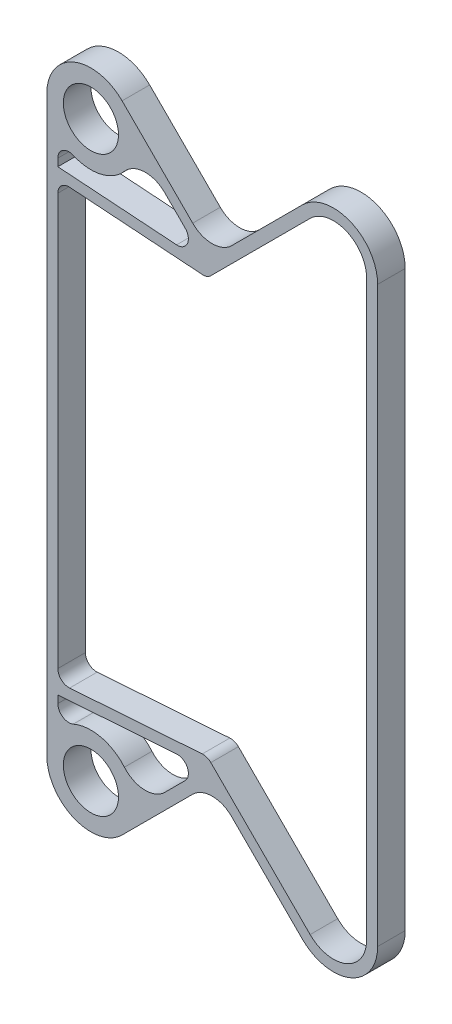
ISO-10303-21;
HEADER;
FILE_DESCRIPTION(('STEP AP214'),'2;1');
FILE_NAME('part.step','',(''),(''),'','','');
FILE_SCHEMA(('AUTOMOTIVE_DESIGN { 1 0 10303 214 1 1 1 1 }'));
ENDSEC;
DATA;
#1=APPLICATION_CONTEXT('core data for automotive mechanical design processes');
#2=APPLICATION_PROTOCOL_DEFINITION('international standard','automotive_design',2000,#1);
#3=PRODUCT_CONTEXT('',#1,'mechanical');
#4=PRODUCT('Part','Part','',(#3));
#5=PRODUCT_RELATED_PRODUCT_CATEGORY('part','',(#4));
#6=PRODUCT_DEFINITION_FORMATION('','',#4);
#7=PRODUCT_DEFINITION_CONTEXT('part definition',#1,'design');
#8=PRODUCT_DEFINITION('design','',#6,#7);
#9=PRODUCT_DEFINITION_SHAPE('','',#8);
#10=(LENGTH_UNIT() NAMED_UNIT(*) SI_UNIT(.MILLI.,.METRE.));
#11=(NAMED_UNIT(*) PLANE_ANGLE_UNIT() SI_UNIT($,.RADIAN.));
#12=(NAMED_UNIT(*) SI_UNIT($,.STERADIAN.) SOLID_ANGLE_UNIT());
#13=UNCERTAINTY_MEASURE_WITH_UNIT(LENGTH_MEASURE(1.E-05),#10,'distance_accuracy_value','');
#14=(GEOMETRIC_REPRESENTATION_CONTEXT(3) GLOBAL_UNCERTAINTY_ASSIGNED_CONTEXT((#13)) GLOBAL_UNIT_ASSIGNED_CONTEXT((#10,
#11,#12)) REPRESENTATION_CONTEXT('',''));
#15=CARTESIAN_POINT('',(0.,0.,0.));
#16=DIRECTION('',(0.,0.,1.));
#17=DIRECTION('',(1.,0.,0.));
#18=AXIS2_PLACEMENT_3D('',#15,#16,#17);
#19=CARTESIAN_POINT('',(299.967205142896,0.,50.));
#20=DIRECTION('',(-1.,0.,0.));
#21=DIRECTION('',(0.,-1.,0.));
#22=AXIS2_PLACEMENT_3D('',#19,#20,#21);
#23=PLANE('',#22);
#24=DIRECTION('',(0.,1.,0.));
#25=VECTOR('',#24,1.);
#26=CARTESIAN_POINT('',(299.967205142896,0.,0.));
#27=LINE('',#26,#25);
#28=CARTESIAN_POINT('',(299.967205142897,-517.709563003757,0.));
#29=VERTEX_POINT('',#28);
#30=CARTESIAN_POINT('',(299.967205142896,517.70956300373,0.));
#31=VERTEX_POINT('',#30);
#32=EDGE_CURVE('E451',#29,#31,#27,.T.);
#33=ORIENTED_EDGE('',*,*,#32,.F.);
#34=DIRECTION('',(0.,0.,-1.));
#35=VECTOR('',#34,1.);
#36=CARTESIAN_POINT('',(299.967205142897,-517.709563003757,50.));
#37=LINE('',#36,#35);
#38=CARTESIAN_POINT('',(299.967205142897,-517.709563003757,50.));
#39=VERTEX_POINT('',#38);
#40=EDGE_CURVE('E11',#39,#29,#37,.T.);
#41=ORIENTED_EDGE('',*,*,#40,.F.);
#42=DIRECTION('',(0.,1.,0.));
#43=VECTOR('',#42,1.);
#44=CARTESIAN_POINT('',(299.967205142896,0.,50.));
#45=LINE('',#44,#43);
#46=CARTESIAN_POINT('',(299.967205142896,517.70956300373,50.));
#47=VERTEX_POINT('',#46);
#48=EDGE_CURVE('E738',#39,#47,#45,.T.);
#49=ORIENTED_EDGE('',*,*,#48,.T.);
#50=DIRECTION('',(0.,0.,-1.));
#51=VECTOR('',#50,1.);
#52=CARTESIAN_POINT('',(299.967205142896,517.70956300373,50.));
#53=LINE('',#52,#51);
#54=EDGE_CURVE('E66',#47,#31,#53,.T.);
#55=ORIENTED_EDGE('',*,*,#54,.T.);
#56=EDGE_LOOP('',(#33,#41,#49,#55));
#57=FACE_BOUND('',#56,.T.);
#58=ADVANCED_FACE('F46',(#57),#23,.T.);
#59=CARTESIAN_POINT('',(219.999999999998,-519.999999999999,50.));
#60=DIRECTION('',(0.,0.,-1.));
#61=DIRECTION('',(-1.,0.,0.));
#62=AXIS2_PLACEMENT_3D('',#59,#60,#61);
#63=CYLINDRICAL_SURFACE('',#62,80.0000000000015);
#64=CARTESIAN_POINT('',(219.999999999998,-519.999999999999,0.));
#65=DIRECTION('',(0.,0.,1.));
#66=DIRECTION('',(1.,0.,0.));
#67=AXIS2_PLACEMENT_3D('',#64,#65,#66);
#68=CIRCLE('',#67,80.0000000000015);
#69=CARTESIAN_POINT('',(299.967205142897,-522.29043699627,0.));
#70=VERTEX_POINT('',#69);
#71=EDGE_CURVE('E454',#29,#70,#68,.F.);
#72=ORIENTED_EDGE('',*,*,#71,.T.);
#73=DIRECTION('',(0.,0.,-1.));
#74=VECTOR('',#73,1.);
#75=CARTESIAN_POINT('',(299.967205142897,-522.29043699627,50.));
#76=LINE('',#75,#74);
#77=CARTESIAN_POINT('',(299.967205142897,-522.29043699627,50.));
#78=VERTEX_POINT('',#77);
#79=EDGE_CURVE('E57',#78,#70,#76,.T.);
#80=ORIENTED_EDGE('',*,*,#79,.F.);
#81=CARTESIAN_POINT('',(219.999999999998,-519.999999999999,50.));
#82=DIRECTION('',(0.,0.,1.));
#83=DIRECTION('',(1.,0.,0.));
#84=AXIS2_PLACEMENT_3D('',#81,#82,#83);
#85=CIRCLE('',#84,80.0000000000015);
#86=EDGE_CURVE('E741',#39,#78,#85,.F.);
#87=ORIENTED_EDGE('',*,*,#86,.F.);
#88=ORIENTED_EDGE('',*,*,#40,.T.);
#89=EDGE_LOOP('',(#72,#80,#87,#88));
#90=FACE_BOUND('',#89,.T.);
#91=ADVANCED_FACE('F796',(#90),#63,.F.);
#92=CARTESIAN_POINT('',(379.934410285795,-519.999999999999,50.));
#93=DIRECTION('',(0.,0.,-1.));
#94=DIRECTION('',(-1.,0.,0.));
#95=AXIS2_PLACEMENT_3D('',#92,#93,#94);
#96=CYLINDRICAL_SURFACE('',#95,80.0000000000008);
#97=CARTESIAN_POINT('',(379.934410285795,-519.999999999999,0.));
#98=DIRECTION('',(0.,0.,1.));
#99=DIRECTION('',(1.,0.,0.));
#100=AXIS2_PLACEMENT_3D('',#97,#98,#99);
#101=CIRCLE('',#100,80.0000000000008);
#102=CARTESIAN_POINT('',(436.502952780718,-576.568542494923,0.));
#103=VERTEX_POINT('',#102);
#104=EDGE_CURVE('E458',#70,#103,#101,.T.);
#105=ORIENTED_EDGE('',*,*,#104,.T.);
#106=DIRECTION('',(0.,0.,-1.));
#107=VECTOR('',#106,1.);
#108=CARTESIAN_POINT('',(436.502952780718,-576.568542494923,50.));
#109=LINE('',#108,#107);
#110=CARTESIAN_POINT('',(436.502952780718,-576.568542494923,50.));
#111=VERTEX_POINT('',#110);
#112=EDGE_CURVE('E532',#111,#103,#109,.T.);
#113=ORIENTED_EDGE('',*,*,#112,.F.);
#114=CARTESIAN_POINT('',(379.934410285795,-519.999999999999,50.));
#115=DIRECTION('',(0.,0.,1.));
#116=DIRECTION('',(1.,0.,0.));
#117=AXIS2_PLACEMENT_3D('',#114,#115,#116);
#118=CIRCLE('',#117,80.0000000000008);
#119=EDGE_CURVE('E745',#78,#111,#118,.T.);
#120=ORIENTED_EDGE('',*,*,#119,.F.);
#121=ORIENTED_EDGE('',*,*,#79,.T.);
#122=EDGE_LOOP('',(#105,#113,#120,#121));
#123=FACE_BOUND('',#122,.T.);
#124=ADVANCED_FACE('F801',(#123),#96,.T.);
#125=CARTESIAN_POINT('',(506.53574763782,-506.535747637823,50.));
#126=DIRECTION('',(0.707106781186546,-0.70710678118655,0.));
#127=DIRECTION('',(0.70710678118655,0.707106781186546,0.));
#128=AXIS2_PLACEMENT_3D('',#125,#126,#127);
#129=PLANE('',#128);
#130=DIRECTION('',(-0.70710678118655,-0.707106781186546,0.));
#131=VECTOR('',#130,1.);
#132=CARTESIAN_POINT('',(506.53574763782,-506.535747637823,0.));
#133=LINE('',#132,#131);
#134=CARTESIAN_POINT('',(564.579071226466,-448.492424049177,0.));
#135=VERTEX_POINT('',#134);
#136=EDGE_CURVE('E462',#135,#103,#133,.T.);
#137=ORIENTED_EDGE('',*,*,#136,.F.);
#138=DIRECTION('',(0.,0.,-1.));
#139=VECTOR('',#138,1.);
#140=CARTESIAN_POINT('',(564.579071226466,-448.492424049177,50.));
#141=LINE('',#140,#139);
#142=CARTESIAN_POINT('',(564.579071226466,-448.492424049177,50.));
#143=VERTEX_POINT('',#142);
#144=EDGE_CURVE('E529',#143,#135,#141,.T.);
#145=ORIENTED_EDGE('',*,*,#144,.F.);
#146=DIRECTION('',(-0.70710678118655,-0.707106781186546,0.));
#147=VECTOR('',#146,1.);
#148=CARTESIAN_POINT('',(506.53574763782,-506.535747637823,50.));
#149=LINE('',#148,#147);
#150=EDGE_CURVE('E748',#143,#111,#149,.T.);
#151=ORIENTED_EDGE('',*,*,#150,.T.);
#152=ORIENTED_EDGE('',*,*,#112,.T.);
#153=EDGE_LOOP('',(#137,#145,#151,#152));
#154=FACE_BOUND('',#153,.T.);
#155=ADVANCED_FACE('F1069',(#154),#129,.T.);
#156=CARTESIAN_POINT('',(599.934410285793,-483.847763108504,50.));
#157=DIRECTION('',(0.,0.,-1.));
#158=DIRECTION('',(-1.,0.,0.));
#159=AXIS2_PLACEMENT_3D('',#156,#157,#158);
#160=CYLINDRICAL_SURFACE('',#159,50.0000000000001);
#161=CARTESIAN_POINT('',(599.934410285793,-483.847763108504,0.));
#162=DIRECTION('',(0.,0.,1.));
#163=DIRECTION('',(1.,0.,0.));
#164=AXIS2_PLACEMENT_3D('',#161,#162,#163);
#165=CIRCLE('',#164,50.0000000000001);
#166=CARTESIAN_POINT('',(635.289749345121,-448.492424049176,0.));
#167=VERTEX_POINT('',#166);
#168=EDGE_CURVE('E466',#135,#167,#165,.F.);
#169=ORIENTED_EDGE('',*,*,#168,.T.);
#170=DIRECTION('',(0.,0.,-1.));
#171=VECTOR('',#170,1.);
#172=CARTESIAN_POINT('',(635.289749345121,-448.492424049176,50.));
#173=LINE('',#172,#171);
#174=CARTESIAN_POINT('',(635.289749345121,-448.492424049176,50.));
#175=VERTEX_POINT('',#174);
#176=EDGE_CURVE('E526',#175,#167,#173,.T.);
#177=ORIENTED_EDGE('',*,*,#176,.F.);
#178=CARTESIAN_POINT('',(599.934410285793,-483.847763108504,50.));
#179=DIRECTION('',(0.,0.,1.));
#180=DIRECTION('',(1.,0.,0.));
#181=AXIS2_PLACEMENT_3D('',#178,#179,#180);
#182=CIRCLE('',#181,50.0000000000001);
#183=EDGE_CURVE('E752',#143,#175,#182,.F.);
#184=ORIENTED_EDGE('',*,*,#183,.F.);
#185=ORIENTED_EDGE('',*,*,#144,.T.);
#186=EDGE_LOOP('',(#169,#177,#184,#185));
#187=FACE_BOUND('',#186,.T.);
#188=ADVANCED_FACE('F1060',(#187),#160,.F.);
#189=CARTESIAN_POINT('',(93.3986626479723,93.3986626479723,50.));
#190=DIRECTION('',(-0.707106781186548,-0.707106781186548,0.));
#191=DIRECTION('',(0.707106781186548,-0.707106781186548,0.));
#192=AXIS2_PLACEMENT_3D('',#189,#190,#191);
#193=PLANE('',#192);
#194=DIRECTION('',(-0.707106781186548,0.707106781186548,0.));
#195=VECTOR('',#194,1.);
#196=CARTESIAN_POINT('',(93.3986626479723,93.3986626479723,0.));
#197=LINE('',#196,#195);
#198=CARTESIAN_POINT('',(763.365867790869,-576.568542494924,0.));
#199=VERTEX_POINT('',#198);
#200=EDGE_CURVE('E470',#199,#167,#197,.T.);
#201=ORIENTED_EDGE('',*,*,#200,.F.);
#202=DIRECTION('',(0.,0.,-1.));
#203=VECTOR('',#202,1.);
#204=CARTESIAN_POINT('',(763.365867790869,-576.568542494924,50.));
#205=LINE('',#204,#203);
#206=CARTESIAN_POINT('',(763.365867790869,-576.568542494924,50.));
#207=VERTEX_POINT('',#206);
#208=EDGE_CURVE('E523',#207,#199,#205,.T.);
#209=ORIENTED_EDGE('',*,*,#208,.F.);
#210=DIRECTION('',(-0.707106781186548,0.707106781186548,0.));
#211=VECTOR('',#210,1.);
#212=CARTESIAN_POINT('',(93.3986626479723,93.3986626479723,50.));
#213=LINE('',#212,#211);
#214=EDGE_CURVE('E755',#207,#175,#213,.T.);
#215=ORIENTED_EDGE('',*,*,#214,.T.);
#216=ORIENTED_EDGE('',*,*,#176,.T.);
#217=EDGE_LOOP('',(#201,#209,#215,#216));
#218=FACE_BOUND('',#217,.T.);
#219=ADVANCED_FACE('F1052',(#218),#193,.T.);
#220=CARTESIAN_POINT('',(819.934410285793,-520.,50.));
#221=DIRECTION('',(0.,0.,-1.));
#222=DIRECTION('',(-1.,0.,0.));
#223=AXIS2_PLACEMENT_3D('',#220,#221,#222);
#224=CYLINDRICAL_SURFACE('',#223,80.0000000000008);
#225=CARTESIAN_POINT('',(819.934410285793,-520.,0.));
#226=DIRECTION('',(0.,0.,1.));
#227=DIRECTION('',(1.,0.,0.));
#228=AXIS2_PLACEMENT_3D('',#225,#226,#227);
#229=CIRCLE('',#228,80.0000000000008);
#230=CARTESIAN_POINT('',(899.934410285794,-519.999999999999,0.));
#231=VERTEX_POINT('',#230);
#232=EDGE_CURVE('E474',#199,#231,#229,.T.);
#233=ORIENTED_EDGE('',*,*,#232,.T.);
#234=DIRECTION('',(0.,0.,-1.));
#235=VECTOR('',#234,1.);
#236=CARTESIAN_POINT('',(899.934410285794,-519.999999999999,50.));
#237=LINE('',#236,#235);
#238=CARTESIAN_POINT('',(899.934410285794,-519.999999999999,50.));
#239=VERTEX_POINT('',#238);
#240=EDGE_CURVE('E520',#239,#231,#237,.T.);
#241=ORIENTED_EDGE('',*,*,#240,.F.);
#242=CARTESIAN_POINT('',(819.934410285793,-520.,50.));
#243=DIRECTION('',(0.,0.,1.));
#244=DIRECTION('',(1.,0.,0.));
#245=AXIS2_PLACEMENT_3D('',#242,#243,#244);
#246=CIRCLE('',#245,80.0000000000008);
#247=EDGE_CURVE('E759',#207,#239,#246,.T.);
#248=ORIENTED_EDGE('',*,*,#247,.F.);
#249=ORIENTED_EDGE('',*,*,#208,.T.);
#250=EDGE_LOOP('',(#233,#241,#248,#249));
#251=FACE_BOUND('',#250,.T.);
#252=ADVANCED_FACE('F1042',(#251),#224,.T.);
#253=CARTESIAN_POINT('',(899.934410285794,0.,50.));
#254=DIRECTION('',(1.,0.,0.));
#255=DIRECTION('',(0.,1.,0.));
#256=AXIS2_PLACEMENT_3D('',#253,#254,#255);
#257=PLANE('',#256);
#258=DIRECTION('',(0.,-1.,0.));
#259=VECTOR('',#258,1.);
#260=CARTESIAN_POINT('',(899.934410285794,0.,0.));
#261=LINE('',#260,#259);
#262=CARTESIAN_POINT('',(899.934410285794,519.999999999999,0.));
#263=VERTEX_POINT('',#262);
#264=EDGE_CURVE('E478',#263,#231,#261,.T.);
#265=ORIENTED_EDGE('',*,*,#264,.F.);
#266=DIRECTION('',(0.,0.,-1.));
#267=VECTOR('',#266,1.);
#268=CARTESIAN_POINT('',(899.934410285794,519.999999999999,50.));
#269=LINE('',#268,#267);
#270=CARTESIAN_POINT('',(899.934410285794,519.999999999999,50.));
#271=VERTEX_POINT('',#270);
#272=EDGE_CURVE('E517',#271,#263,#269,.T.);
#273=ORIENTED_EDGE('',*,*,#272,.F.);
#274=DIRECTION('',(0.,-1.,0.));
#275=VECTOR('',#274,1.);
#276=CARTESIAN_POINT('',(899.934410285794,0.,50.));
#277=LINE('',#276,#275);
#278=EDGE_CURVE('E762',#271,#239,#277,.T.);
#279=ORIENTED_EDGE('',*,*,#278,.T.);
#280=ORIENTED_EDGE('',*,*,#240,.T.);
#281=EDGE_LOOP('',(#265,#273,#279,#280));
#282=FACE_BOUND('',#281,.T.);
#283=ADVANCED_FACE('F1034',(#282),#257,.T.);
#284=CARTESIAN_POINT('',(819.934410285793,520.,50.));
#285=DIRECTION('',(0.,0.,-1.));
#286=DIRECTION('',(-1.,0.,0.));
#287=AXIS2_PLACEMENT_3D('',#284,#285,#286);
#288=CYLINDRICAL_SURFACE('',#287,80.0000000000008);
#289=CARTESIAN_POINT('',(819.934410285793,520.,0.));
#290=DIRECTION('',(0.,0.,1.));
#291=DIRECTION('',(1.,0.,0.));
#292=AXIS2_PLACEMENT_3D('',#289,#290,#291);
#293=CIRCLE('',#292,80.0000000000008);
#294=CARTESIAN_POINT('',(763.365867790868,576.568542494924,0.));
#295=VERTEX_POINT('',#294);
#296=EDGE_CURVE('E482',#295,#263,#293,.F.);
#297=ORIENTED_EDGE('',*,*,#296,.F.);
#298=DIRECTION('',(0.,0.,-1.));
#299=VECTOR('',#298,1.);
#300=CARTESIAN_POINT('',(763.365867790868,576.568542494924,50.));
#301=LINE('',#300,#299);
#302=CARTESIAN_POINT('',(763.365867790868,576.568542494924,50.));
#303=VERTEX_POINT('',#302);
#304=EDGE_CURVE('E514',#303,#295,#301,.T.);
#305=ORIENTED_EDGE('',*,*,#304,.F.);
#306=CARTESIAN_POINT('',(819.934410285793,520.,50.));
#307=DIRECTION('',(0.,0.,1.));
#308=DIRECTION('',(1.,0.,0.));
#309=AXIS2_PLACEMENT_3D('',#306,#307,#308);
#310=CIRCLE('',#309,80.0000000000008);
#311=EDGE_CURVE('E766',#303,#271,#310,.F.);
#312=ORIENTED_EDGE('',*,*,#311,.T.);
#313=ORIENTED_EDGE('',*,*,#272,.T.);
#314=EDGE_LOOP('',(#297,#305,#312,#313));
#315=FACE_BOUND('',#314,.T.);
#316=ADVANCED_FACE('F1024',(#315),#288,.T.);
#317=CARTESIAN_POINT('',(93.3986626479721,-93.3986626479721,50.));
#318=DIRECTION('',(0.707106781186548,-0.707106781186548,0.));
#319=DIRECTION('',(0.707106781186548,0.707106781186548,0.));
#320=AXIS2_PLACEMENT_3D('',#317,#318,#319);
#321=PLANE('',#320);
#322=DIRECTION('',(-0.707106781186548,-0.707106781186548,0.));
#323=VECTOR('',#322,1.);
#324=CARTESIAN_POINT('',(93.3986626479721,-93.3986626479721,0.));
#325=LINE('',#324,#323);
#326=CARTESIAN_POINT('',(635.289749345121,448.492424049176,0.));
#327=VERTEX_POINT('',#326);
#328=EDGE_CURVE('E486',#295,#327,#325,.T.);
#329=ORIENTED_EDGE('',*,*,#328,.T.);
#330=DIRECTION('',(0.,0.,-1.));
#331=VECTOR('',#330,1.);
#332=CARTESIAN_POINT('',(635.289749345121,448.492424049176,50.));
#333=LINE('',#332,#331);
#334=CARTESIAN_POINT('',(635.289749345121,448.492424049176,50.));
#335=VERTEX_POINT('',#334);
#336=EDGE_CURVE('E511',#335,#327,#333,.T.);
#337=ORIENTED_EDGE('',*,*,#336,.F.);
#338=DIRECTION('',(-0.707106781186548,-0.707106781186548,0.));
#339=VECTOR('',#338,1.);
#340=CARTESIAN_POINT('',(93.3986626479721,-93.3986626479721,50.));
#341=LINE('',#340,#339);
#342=EDGE_CURVE('E770',#303,#335,#341,.T.);
#343=ORIENTED_EDGE('',*,*,#342,.F.);
#344=ORIENTED_EDGE('',*,*,#304,.T.);
#345=EDGE_LOOP('',(#329,#337,#343,#344));
#346=FACE_BOUND('',#345,.T.);
#347=ADVANCED_FACE('F1016',(#346),#321,.F.);
#348=CARTESIAN_POINT('',(599.934410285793,483.847763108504,50.));
#349=DIRECTION('',(0.,0.,-1.));
#350=DIRECTION('',(-1.,0.,0.));
#351=AXIS2_PLACEMENT_3D('',#348,#349,#350);
#352=CYLINDRICAL_SURFACE('',#351,50.);
#353=CARTESIAN_POINT('',(599.934410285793,483.847763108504,0.));
#354=DIRECTION('',(0.,0.,1.));
#355=DIRECTION('',(1.,0.,0.));
#356=AXIS2_PLACEMENT_3D('',#353,#354,#355);
#357=CIRCLE('',#356,50.);
#358=CARTESIAN_POINT('',(564.579071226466,448.492424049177,0.));
#359=VERTEX_POINT('',#358);
#360=EDGE_CURVE('E490',#359,#327,#357,.T.);
#361=ORIENTED_EDGE('',*,*,#360,.F.);
#362=DIRECTION('',(0.,0.,-1.));
#363=VECTOR('',#362,1.);
#364=CARTESIAN_POINT('',(564.579071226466,448.492424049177,50.));
#365=LINE('',#364,#363);
#366=CARTESIAN_POINT('',(564.579071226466,448.492424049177,50.));
#367=VERTEX_POINT('',#366);
#368=EDGE_CURVE('E332',#367,#359,#365,.T.);
#369=ORIENTED_EDGE('',*,*,#368,.F.);
#370=CARTESIAN_POINT('',(599.934410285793,483.847763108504,50.));
#371=DIRECTION('',(0.,0.,1.));
#372=DIRECTION('',(1.,0.,0.));
#373=AXIS2_PLACEMENT_3D('',#370,#371,#372);
#374=CIRCLE('',#373,50.);
#375=EDGE_CURVE('E320',#367,#335,#374,.T.);
#376=ORIENTED_EDGE('',*,*,#375,.T.);
#377=ORIENTED_EDGE('',*,*,#336,.T.);
#378=EDGE_LOOP('',(#361,#369,#376,#377));
#379=FACE_BOUND('',#378,.T.);
#380=ADVANCED_FACE('F776',(#379),#352,.F.);
#381=CARTESIAN_POINT('',(506.535747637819,506.535747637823,50.));
#382=DIRECTION('',(-0.707106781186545,-0.70710678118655,0.));
#383=DIRECTION('',(0.70710678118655,-0.707106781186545,0.));
#384=AXIS2_PLACEMENT_3D('',#381,#382,#383);
#385=PLANE('',#384);
#386=DIRECTION('',(-0.70710678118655,0.707106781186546,0.));
#387=VECTOR('',#386,1.);
#388=CARTESIAN_POINT('',(506.535747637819,506.535747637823,0.));
#389=LINE('',#388,#387);
#390=CARTESIAN_POINT('',(436.502952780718,576.568542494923,0.));
#391=VERTEX_POINT('',#390);
#392=EDGE_CURVE('E328',#359,#391,#389,.T.);
#393=ORIENTED_EDGE('',*,*,#392,.T.);
#394=DIRECTION('',(0.,0.,-1.));
#395=VECTOR('',#394,1.);
#396=CARTESIAN_POINT('',(436.502952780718,576.568542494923,50.));
#397=LINE('',#396,#395);
#398=CARTESIAN_POINT('',(436.502952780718,576.568542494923,50.));
#399=VERTEX_POINT('',#398);
#400=EDGE_CURVE('E325',#399,#391,#397,.T.);
#401=ORIENTED_EDGE('',*,*,#400,.F.);
#402=DIRECTION('',(-0.70710678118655,0.707106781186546,0.));
#403=VECTOR('',#402,1.);
#404=CARTESIAN_POINT('',(506.535747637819,506.535747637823,50.));
#405=LINE('',#404,#403);
#406=EDGE_CURVE('E312',#367,#399,#405,.T.);
#407=ORIENTED_EDGE('',*,*,#406,.F.);
#408=ORIENTED_EDGE('',*,*,#368,.T.);
#409=EDGE_LOOP('',(#393,#401,#407,#408));
#410=FACE_BOUND('',#409,.T.);
#411=ADVANCED_FACE('F326',(#410),#385,.F.);
#412=CARTESIAN_POINT('',(379.934410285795,519.999999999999,50.));
#413=DIRECTION('',(0.,0.,-1.));
#414=DIRECTION('',(-1.,0.,0.));
#415=AXIS2_PLACEMENT_3D('',#412,#413,#414);
#416=CYLINDRICAL_SURFACE('',#415,80.0000000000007);
#417=CARTESIAN_POINT('',(379.934410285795,519.999999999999,0.));
#418=DIRECTION('',(0.,0.,1.));
#419=DIRECTION('',(1.,0.,0.));
#420=AXIS2_PLACEMENT_3D('',#417,#418,#419);
#421=CIRCLE('',#420,80.0000000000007);
#422=CARTESIAN_POINT('',(299.967205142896,522.29043699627,0.));
#423=VERTEX_POINT('',#422);
#424=EDGE_CURVE('E496',#423,#391,#421,.F.);
#425=ORIENTED_EDGE('',*,*,#424,.F.);
#426=DIRECTION('',(0.,0.,-1.));
#427=VECTOR('',#426,1.);
#428=CARTESIAN_POINT('',(299.967205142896,522.29043699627,50.));
#429=LINE('',#428,#427);
#430=CARTESIAN_POINT('',(299.967205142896,522.29043699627,50.));
#431=VERTEX_POINT('',#430);
#432=EDGE_CURVE('E187',#431,#423,#429,.T.);
#433=ORIENTED_EDGE('',*,*,#432,.F.);
#434=CARTESIAN_POINT('',(379.934410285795,519.999999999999,50.));
#435=DIRECTION('',(0.,0.,1.));
#436=DIRECTION('',(1.,0.,0.));
#437=AXIS2_PLACEMENT_3D('',#434,#435,#436);
#438=CIRCLE('',#437,80.0000000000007);
#439=EDGE_CURVE('E318',#431,#399,#438,.F.);
#440=ORIENTED_EDGE('',*,*,#439,.T.);
#441=ORIENTED_EDGE('',*,*,#400,.T.);
#442=EDGE_LOOP('',(#425,#433,#440,#441));
#443=FACE_BOUND('',#442,.T.);
#444=ADVANCED_FACE('F334',(#443),#416,.T.);
#445=CARTESIAN_POINT('',(107.540798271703,107.540798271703,50.));
#446=DIRECTION('',(-0.707106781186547,-0.707106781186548,0.));
#447=DIRECTION('',(0.707106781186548,-0.707106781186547,0.));
#448=AXIS2_PLACEMENT_3D('',#445,#446,#447);
#449=PLANE('',#448);
#450=DIRECTION('',(-0.707106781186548,0.707106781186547,0.));
#451=VECTOR('',#450,1.);
#452=CARTESIAN_POINT('',(107.540798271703,107.540798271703,0.));
#453=LINE('',#452,#451);
#454=CARTESIAN_POINT('',(777.5080034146,-562.426406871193,0.));
#455=VERTEX_POINT('',#454);
#456=CARTESIAN_POINT('',(597.433394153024,-382.351797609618,0.));
#457=VERTEX_POINT('',#456);
#458=EDGE_CURVE('E406',#455,#457,#453,.T.);
#459=ORIENTED_EDGE('',*,*,#458,.T.);
#460=DIRECTION('',(0.,0.,-1.));
#461=VECTOR('',#460,1.);
#462=CARTESIAN_POINT('',(597.433394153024,-382.351797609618,50.));
#463=LINE('',#462,#461);
#464=CARTESIAN_POINT('',(597.433394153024,-382.351797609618,50.));
#465=VERTEX_POINT('',#464);
#466=EDGE_CURVE('E506',#465,#457,#463,.T.);
#467=ORIENTED_EDGE('',*,*,#466,.F.);
#468=DIRECTION('',(-0.707106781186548,0.707106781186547,0.));
#469=VECTOR('',#468,1.);
#470=CARTESIAN_POINT('',(107.540798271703,107.540798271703,50.));
#471=LINE('',#470,#469);
#472=CARTESIAN_POINT('',(777.5080034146,-562.426406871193,50.));
#473=VERTEX_POINT('',#472);
#474=EDGE_CURVE('E696',#473,#465,#471,.T.);
#475=ORIENTED_EDGE('',*,*,#474,.F.);
#476=DIRECTION('',(0.,0.,-1.));
#477=VECTOR('',#476,1.);
#478=CARTESIAN_POINT('',(777.5080034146,-562.426406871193,50.));
#479=LINE('',#478,#477);
#480=EDGE_CURVE('E538',#473,#455,#479,.T.);
#481=ORIENTED_EDGE('',*,*,#480,.T.);
#482=EDGE_LOOP('',(#459,#467,#475,#481));
#483=FACE_BOUND('',#482,.T.);
#484=ADVANCED_FACE('F852',(#483),#449,.F.);
#485=CARTESIAN_POINT('',(583.291258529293,-396.493933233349,50.));
#486=DIRECTION('',(0.,0.,-1.));
#487=DIRECTION('',(-1.,0.,0.));
#488=AXIS2_PLACEMENT_3D('',#485,#486,#487);
#489=CYLINDRICAL_SURFACE('',#488,20.);
#490=CARTESIAN_POINT('',(583.291258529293,-396.493933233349,0.));
#491=DIRECTION('',(0.,0.,1.));
#492=DIRECTION('',(1.,0.,0.));
#493=AXIS2_PLACEMENT_3D('',#490,#491,#492);
#494=CIRCLE('',#493,20.);
#495=CARTESIAN_POINT('',(581.903512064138,-376.542137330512,0.));
#496=VERTEX_POINT('',#495);
#497=EDGE_CURVE('E410',#457,#496,#494,.T.);
#498=ORIENTED_EDGE('',*,*,#497,.T.);
#499=DIRECTION('',(0.,0.,-1.));
#500=VECTOR('',#499,1.);
#501=CARTESIAN_POINT('',(581.903512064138,-376.542137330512,50.));
#502=LINE('',#501,#500);
#503=CARTESIAN_POINT('',(581.903512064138,-376.542137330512,50.));
#504=VERTEX_POINT('',#503);
#505=EDGE_CURVE('E572',#504,#496,#502,.T.);
#506=ORIENTED_EDGE('',*,*,#505,.F.);
#507=CARTESIAN_POINT('',(583.291258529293,-396.493933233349,50.));
#508=DIRECTION('',(0.,0.,1.));
#509=DIRECTION('',(1.,0.,0.));
#510=AXIS2_PLACEMENT_3D('',#507,#508,#509);
#511=CIRCLE('',#510,20.);
#512=EDGE_CURVE('E700',#465,#504,#511,.T.);
#513=ORIENTED_EDGE('',*,*,#512,.F.);
#514=ORIENTED_EDGE('',*,*,#466,.T.);
#515=EDGE_LOOP('',(#498,#506,#513,#514));
#516=FACE_BOUND('',#515,.T.);
#517=ADVANCED_FACE('F848',(#516),#489,.T.);
#518=CARTESIAN_POINT('',(28.8659119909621,-415.00864823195,50.));
#519=DIRECTION('',(-0.0693873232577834,0.997589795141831,0.));
#520=DIRECTION('',(-0.997589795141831,-0.0693873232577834,0.));
#521=AXIS2_PLACEMENT_3D('',#518,#519,#520);
#522=PLANE('',#521);
#523=DIRECTION('',(0.997589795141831,0.0693873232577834,0.));
#524=VECTOR('',#523,1.);
#525=CARTESIAN_POINT('',(28.8659119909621,-415.00864823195,0.));
#526=LINE('',#525,#524);
#527=CARTESIAN_POINT('',(341.354951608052,-393.273484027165,0.));
#528=VERTEX_POINT('',#527);
#529=EDGE_CURVE('E414',#528,#496,#526,.T.);
#530=ORIENTED_EDGE('',*,*,#529,.F.);
#531=DIRECTION('',(0.,0.,-1.));
#532=VECTOR('',#531,1.);
#533=CARTESIAN_POINT('',(341.354951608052,-393.273484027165,50.));
#534=LINE('',#533,#532);
#535=CARTESIAN_POINT('',(341.354951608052,-393.273484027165,50.));
#536=VERTEX_POINT('',#535);
#537=EDGE_CURVE('E569',#536,#528,#534,.T.);
#538=ORIENTED_EDGE('',*,*,#537,.F.);
#539=DIRECTION('',(0.997589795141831,0.0693873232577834,0.));
#540=VECTOR('',#539,1.);
#541=CARTESIAN_POINT('',(28.8659119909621,-415.00864823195,50.));
#542=LINE('',#541,#540);
#543=EDGE_CURVE('E703',#536,#504,#542,.T.);
#544=ORIENTED_EDGE('',*,*,#543,.T.);
#545=ORIENTED_EDGE('',*,*,#505,.T.);
#546=EDGE_LOOP('',(#530,#538,#544,#545));
#547=FACE_BOUND('',#546,.T.);
#548=ADVANCED_FACE('F844',(#547),#522,.T.);
#549=CARTESIAN_POINT('',(339.967205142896,-373.321688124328,50.));
#550=DIRECTION('',(0.,0.,-1.));
#551=DIRECTION('',(-1.,0.,0.));
#552=AXIS2_PLACEMENT_3D('',#549,#550,#551);
#553=CYLINDRICAL_SURFACE('',#552,20.);
#554=CARTESIAN_POINT('',(339.967205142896,-373.321688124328,0.));
#555=DIRECTION('',(0.,0.,1.));
#556=DIRECTION('',(1.,0.,0.));
#557=AXIS2_PLACEMENT_3D('',#554,#555,#556);
#558=CIRCLE('',#557,20.);
#559=CARTESIAN_POINT('',(319.967205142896,-373.321688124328,0.));
#560=VERTEX_POINT('',#559);
#561=EDGE_CURVE('E418',#560,#528,#558,.T.);
#562=ORIENTED_EDGE('',*,*,#561,.F.);
#563=DIRECTION('',(0.,0.,-1.));
#564=VECTOR('',#563,1.);
#565=CARTESIAN_POINT('',(319.967205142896,-373.321688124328,50.));
#566=LINE('',#565,#564);
#567=CARTESIAN_POINT('',(319.967205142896,-373.321688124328,50.));
#568=VERTEX_POINT('',#567);
#569=EDGE_CURVE('E566',#568,#560,#566,.T.);
#570=ORIENTED_EDGE('',*,*,#569,.F.);
#571=CARTESIAN_POINT('',(339.967205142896,-373.321688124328,50.));
#572=DIRECTION('',(0.,0.,1.));
#573=DIRECTION('',(1.,0.,0.));
#574=AXIS2_PLACEMENT_3D('',#571,#572,#573);
#575=CIRCLE('',#574,20.);
#576=EDGE_CURVE('E707',#568,#536,#575,.T.);
#577=ORIENTED_EDGE('',*,*,#576,.T.);
#578=ORIENTED_EDGE('',*,*,#537,.T.);
#579=EDGE_LOOP('',(#562,#570,#577,#578));
#580=FACE_BOUND('',#579,.T.);
#581=ADVANCED_FACE('F840',(#580),#553,.F.);
#582=CARTESIAN_POINT('',(319.967205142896,0.,50.));
#583=DIRECTION('',(-1.,0.,0.));
#584=DIRECTION('',(0.,-1.,0.));
#585=AXIS2_PLACEMENT_3D('',#582,#583,#584);
#586=PLANE('',#585);
#587=DIRECTION('',(0.,1.,0.));
#588=VECTOR('',#587,1.);
#589=CARTESIAN_POINT('',(319.967205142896,0.,0.));
#590=LINE('',#589,#588);
#591=CARTESIAN_POINT('',(319.967205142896,373.321688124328,0.));
#592=VERTEX_POINT('',#591);
#593=EDGE_CURVE('E422',#560,#592,#590,.T.);
#594=ORIENTED_EDGE('',*,*,#593,.T.);
#595=DIRECTION('',(0.,0.,-1.));
#596=VECTOR('',#595,1.);
#597=CARTESIAN_POINT('',(319.967205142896,373.321688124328,50.));
#598=LINE('',#597,#596);
#599=CARTESIAN_POINT('',(319.967205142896,373.321688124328,50.));
#600=VERTEX_POINT('',#599);
#601=EDGE_CURVE('E562',#600,#592,#598,.T.);
#602=ORIENTED_EDGE('',*,*,#601,.F.);
#603=DIRECTION('',(0.,1.,0.));
#604=VECTOR('',#603,1.);
#605=CARTESIAN_POINT('',(319.967205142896,0.,50.));
#606=LINE('',#605,#604);
#607=EDGE_CURVE('E711',#568,#600,#606,.T.);
#608=ORIENTED_EDGE('',*,*,#607,.F.);
#609=ORIENTED_EDGE('',*,*,#569,.T.);
#610=EDGE_LOOP('',(#594,#602,#608,#609));
#611=FACE_BOUND('',#610,.T.);
#612=ADVANCED_FACE('F836',(#611),#586,.F.);
#613=CARTESIAN_POINT('',(339.967205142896,373.321688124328,50.));
#614=DIRECTION('',(0.,0.,-1.));
#615=DIRECTION('',(-1.,0.,0.));
#616=AXIS2_PLACEMENT_3D('',#613,#614,#615);
#617=CYLINDRICAL_SURFACE('',#616,20.);
#618=CARTESIAN_POINT('',(339.967205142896,373.321688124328,0.));
#619=DIRECTION('',(0.,0.,1.));
#620=DIRECTION('',(1.,0.,0.));
#621=AXIS2_PLACEMENT_3D('',#618,#619,#620);
#622=CIRCLE('',#621,20.);
#623=CARTESIAN_POINT('',(341.354951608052,393.273484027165,0.));
#624=VERTEX_POINT('',#623);
#625=EDGE_CURVE('E425',#592,#624,#622,.F.);
#626=ORIENTED_EDGE('',*,*,#625,.T.);
#627=DIRECTION('',(0.,0.,-1.));
#628=VECTOR('',#627,1.);
#629=CARTESIAN_POINT('',(341.354951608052,393.273484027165,50.));
#630=LINE('',#629,#628);
#631=CARTESIAN_POINT('',(341.354951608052,393.273484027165,50.));
#632=VERTEX_POINT('',#631);
#633=EDGE_CURVE('E558',#632,#624,#630,.T.);
#634=ORIENTED_EDGE('',*,*,#633,.F.);
#635=CARTESIAN_POINT('',(339.967205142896,373.321688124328,50.));
#636=DIRECTION('',(0.,0.,1.));
#637=DIRECTION('',(1.,0.,0.));
#638=AXIS2_PLACEMENT_3D('',#635,#636,#637);
#639=CIRCLE('',#638,20.);
#640=EDGE_CURVE('E714',#600,#632,#639,.F.);
#641=ORIENTED_EDGE('',*,*,#640,.F.);
#642=ORIENTED_EDGE('',*,*,#601,.T.);
#643=EDGE_LOOP('',(#626,#634,#641,#642));
#644=FACE_BOUND('',#643,.T.);
#645=ADVANCED_FACE('F832',(#644),#617,.F.);
#646=CARTESIAN_POINT('',(28.8659119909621,415.00864823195,50.));
#647=DIRECTION('',(0.0693873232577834,0.997589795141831,0.));
#648=DIRECTION('',(-0.997589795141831,0.0693873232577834,0.));
#649=AXIS2_PLACEMENT_3D('',#646,#647,#648);
#650=PLANE('',#649);
#651=DIRECTION('',(0.997589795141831,-0.0693873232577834,0.));
#652=VECTOR('',#651,1.);
#653=CARTESIAN_POINT('',(28.8659119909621,415.00864823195,0.));
#654=LINE('',#653,#652);
#655=CARTESIAN_POINT('',(581.903512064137,376.542137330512,0.));
#656=VERTEX_POINT('',#655);
#657=EDGE_CURVE('E428',#624,#656,#654,.T.);
#658=ORIENTED_EDGE('',*,*,#657,.T.);
#659=DIRECTION('',(0.,0.,-1.));
#660=VECTOR('',#659,1.);
#661=CARTESIAN_POINT('',(581.903512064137,376.542137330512,50.));
#662=LINE('',#661,#660);
#663=CARTESIAN_POINT('',(581.903512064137,376.542137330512,50.));
#664=VERTEX_POINT('',#663);
#665=EDGE_CURVE('E555',#664,#656,#662,.T.);
#666=ORIENTED_EDGE('',*,*,#665,.F.);
#667=DIRECTION('',(0.997589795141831,-0.0693873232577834,0.));
#668=VECTOR('',#667,1.);
#669=CARTESIAN_POINT('',(28.8659119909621,415.00864823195,50.));
#670=LINE('',#669,#668);
#671=EDGE_CURVE('E717',#632,#664,#670,.T.);
#672=ORIENTED_EDGE('',*,*,#671,.F.);
#673=ORIENTED_EDGE('',*,*,#633,.T.);
#674=EDGE_LOOP('',(#658,#666,#672,#673));
#675=FACE_BOUND('',#674,.T.);
#676=ADVANCED_FACE('F828',(#675),#650,.F.);
#677=CARTESIAN_POINT('',(583.291258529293,396.493933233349,50.));
#678=DIRECTION('',(0.,0.,-1.));
#679=DIRECTION('',(-1.,0.,0.));
#680=AXIS2_PLACEMENT_3D('',#677,#678,#679);
#681=CYLINDRICAL_SURFACE('',#680,20.);
#682=CARTESIAN_POINT('',(583.291258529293,396.493933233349,0.));
#683=DIRECTION('',(0.,0.,1.));
#684=DIRECTION('',(1.,0.,0.));
#685=AXIS2_PLACEMENT_3D('',#682,#683,#684);
#686=CIRCLE('',#685,20.);
#687=CARTESIAN_POINT('',(597.433394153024,382.351797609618,0.));
#688=VERTEX_POINT('',#687);
#689=EDGE_CURVE('E432',#688,#656,#686,.F.);
#690=ORIENTED_EDGE('',*,*,#689,.F.);
#691=DIRECTION('',(0.,0.,-1.));
#692=VECTOR('',#691,1.);
#693=CARTESIAN_POINT('',(597.433394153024,382.351797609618,50.));
#694=LINE('',#693,#692);
#695=CARTESIAN_POINT('',(597.433394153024,382.351797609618,50.));
#696=VERTEX_POINT('',#695);
#697=EDGE_CURVE('E552',#696,#688,#694,.T.);
#698=ORIENTED_EDGE('',*,*,#697,.F.);
#699=CARTESIAN_POINT('',(583.291258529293,396.493933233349,50.));
#700=DIRECTION('',(0.,0.,1.));
#701=DIRECTION('',(1.,0.,0.));
#702=AXIS2_PLACEMENT_3D('',#699,#700,#701);
#703=CIRCLE('',#702,20.);
#704=EDGE_CURVE('E720',#696,#664,#703,.F.);
#705=ORIENTED_EDGE('',*,*,#704,.T.);
#706=ORIENTED_EDGE('',*,*,#665,.T.);
#707=EDGE_LOOP('',(#690,#698,#705,#706));
#708=FACE_BOUND('',#707,.T.);
#709=ADVANCED_FACE('F824',(#708),#681,.T.);
#710=CARTESIAN_POINT('',(107.540798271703,-107.540798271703,50.));
#711=DIRECTION('',(0.707106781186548,-0.707106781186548,0.));
#712=DIRECTION('',(0.707106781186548,0.707106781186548,0.));
#713=AXIS2_PLACEMENT_3D('',#710,#711,#712);
#714=PLANE('',#713);
#715=DIRECTION('',(-0.707106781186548,-0.707106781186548,0.));
#716=VECTOR('',#715,1.);
#717=CARTESIAN_POINT('',(107.540798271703,-107.540798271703,0.));
#718=LINE('',#717,#716);
#719=CARTESIAN_POINT('',(777.508003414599,562.426406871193,0.));
#720=VERTEX_POINT('',#719);
#721=EDGE_CURVE('E436',#720,#688,#718,.T.);
#722=ORIENTED_EDGE('',*,*,#721,.F.);
#723=DIRECTION('',(0.,0.,-1.));
#724=VECTOR('',#723,1.);
#725=CARTESIAN_POINT('',(777.508003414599,562.426406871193,50.));
#726=LINE('',#725,#724);
#727=CARTESIAN_POINT('',(777.508003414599,562.426406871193,50.));
#728=VERTEX_POINT('',#727);
#729=EDGE_CURVE('E549',#728,#720,#726,.T.);
#730=ORIENTED_EDGE('',*,*,#729,.F.);
#731=DIRECTION('',(-0.707106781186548,-0.707106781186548,0.));
#732=VECTOR('',#731,1.);
#733=CARTESIAN_POINT('',(107.540798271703,-107.540798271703,50.));
#734=LINE('',#733,#732);
#735=EDGE_CURVE('E724',#728,#696,#734,.T.);
#736=ORIENTED_EDGE('',*,*,#735,.T.);
#737=ORIENTED_EDGE('',*,*,#697,.T.);
#738=EDGE_LOOP('',(#722,#730,#736,#737));
#739=FACE_BOUND('',#738,.T.);
#740=ADVANCED_FACE('F820',(#739),#714,.T.);
#741=CARTESIAN_POINT('',(819.934410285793,520.,50.));
#742=DIRECTION('',(0.,0.,-1.));
#743=DIRECTION('',(-1.,0.,0.));
#744=AXIS2_PLACEMENT_3D('',#741,#742,#743);
#745=CYLINDRICAL_SURFACE('',#744,60.0000000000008);
#746=CARTESIAN_POINT('',(819.934410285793,520.,0.));
#747=DIRECTION('',(0.,0.,1.));
#748=DIRECTION('',(1.,0.,0.));
#749=AXIS2_PLACEMENT_3D('',#746,#747,#748);
#750=CIRCLE('',#749,60.0000000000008);
#751=CARTESIAN_POINT('',(879.934410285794,520.,0.));
#752=VERTEX_POINT('',#751);
#753=EDGE_CURVE('E440',#720,#752,#750,.F.);
#754=ORIENTED_EDGE('',*,*,#753,.T.);
#755=DIRECTION('',(0.,0.,-1.));
#756=VECTOR('',#755,1.);
#757=CARTESIAN_POINT('',(879.934410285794,520.,50.));
#758=LINE('',#757,#756);
#759=CARTESIAN_POINT('',(879.934410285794,520.,50.));
#760=VERTEX_POINT('',#759);
#761=EDGE_CURVE('E545',#760,#752,#758,.T.);
#762=ORIENTED_EDGE('',*,*,#761,.F.);
#763=CARTESIAN_POINT('',(819.934410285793,520.,50.));
#764=DIRECTION('',(0.,0.,1.));
#765=DIRECTION('',(1.,0.,0.));
#766=AXIS2_PLACEMENT_3D('',#763,#764,#765);
#767=CIRCLE('',#766,60.0000000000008);
#768=EDGE_CURVE('E728',#728,#760,#767,.F.);
#769=ORIENTED_EDGE('',*,*,#768,.F.);
#770=ORIENTED_EDGE('',*,*,#729,.T.);
#771=EDGE_LOOP('',(#754,#762,#769,#770));
#772=FACE_BOUND('',#771,.T.);
#773=ADVANCED_FACE('F816',(#772),#745,.F.);
#774=CARTESIAN_POINT('',(879.934410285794,0.,50.));
#775=DIRECTION('',(1.,0.,0.));
#776=DIRECTION('',(0.,1.,0.));
#777=AXIS2_PLACEMENT_3D('',#774,#775,#776);
#778=PLANE('',#777);
#779=DIRECTION('',(0.,-1.,0.));
#780=VECTOR('',#779,1.);
#781=CARTESIAN_POINT('',(879.934410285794,0.,0.));
#782=LINE('',#781,#780);
#783=CARTESIAN_POINT('',(879.934410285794,-519.999999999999,0.));
#784=VERTEX_POINT('',#783);
#785=EDGE_CURVE('E443',#752,#784,#782,.T.);
#786=ORIENTED_EDGE('',*,*,#785,.T.);
#787=DIRECTION('',(0.,0.,-1.));
#788=VECTOR('',#787,1.);
#789=CARTESIAN_POINT('',(879.934410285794,-519.999999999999,50.));
#790=LINE('',#789,#788);
#791=CARTESIAN_POINT('',(879.934410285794,-519.999999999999,50.));
#792=VERTEX_POINT('',#791);
#793=EDGE_CURVE('E541',#792,#784,#790,.T.);
#794=ORIENTED_EDGE('',*,*,#793,.F.);
#795=DIRECTION('',(0.,-1.,0.));
#796=VECTOR('',#795,1.);
#797=CARTESIAN_POINT('',(879.934410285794,0.,50.));
#798=LINE('',#797,#796);
#799=EDGE_CURVE('E731',#760,#792,#798,.T.);
#800=ORIENTED_EDGE('',*,*,#799,.F.);
#801=ORIENTED_EDGE('',*,*,#761,.T.);
#802=EDGE_LOOP('',(#786,#794,#800,#801));
#803=FACE_BOUND('',#802,.T.);
#804=ADVANCED_FACE('F812',(#803),#778,.F.);
#805=CARTESIAN_POINT('',(379.934410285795,519.999999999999,50.));
#806=DIRECTION('',(0.,0.,-1.));
#807=DIRECTION('',(-1.,0.,0.));
#808=AXIS2_PLACEMENT_3D('',#805,#806,#807);
#809=CYLINDRICAL_SURFACE('',#808,80.0000000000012);
#810=CARTESIAN_POINT('',(379.934410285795,519.999999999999,0.));
#811=DIRECTION('',(0.,0.,1.));
#812=DIRECTION('',(1.,0.,0.));
#813=AXIS2_PLACEMENT_3D('',#810,#811,#812);
#814=CIRCLE('',#813,80.0000000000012);
#815=CARTESIAN_POINT('',(440.686768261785,467.950494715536,0.));
#816=VERTEX_POINT('',#815);
#817=CARTESIAN_POINT('',(347.960646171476,446.66734418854,0.));
#818=VERTEX_POINT('',#817);
#819=EDGE_CURVE('E374',#816,#818,#814,.F.);
#820=ORIENTED_EDGE('',*,*,#819,.F.);
#821=DIRECTION('',(0.,0.,-1.));
#822=VECTOR('',#821,1.);
#823=CARTESIAN_POINT('',(440.686768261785,467.950494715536,50.));
#824=LINE('',#823,#822);
#825=CARTESIAN_POINT('',(440.686768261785,467.950494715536,50.));
#826=VERTEX_POINT('',#825);
#827=EDGE_CURVE('E542',#826,#816,#824,.T.);
#828=ORIENTED_EDGE('',*,*,#827,.F.);
#829=CARTESIAN_POINT('',(379.934410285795,519.999999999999,50.));
#830=DIRECTION('',(0.,0.,1.));
#831=DIRECTION('',(1.,0.,0.));
#832=AXIS2_PLACEMENT_3D('',#829,#830,#831);
#833=CIRCLE('',#832,80.0000000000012);
#834=CARTESIAN_POINT('',(347.960646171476,446.66734418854,50.));
#835=VERTEX_POINT('',#834);
#836=EDGE_CURVE('E666',#826,#835,#833,.F.);
#837=ORIENTED_EDGE('',*,*,#836,.T.);
#838=DIRECTION('',(0.,0.,-1.));
#839=VECTOR('',#838,1.);
#840=CARTESIAN_POINT('',(347.960646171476,446.66734418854,50.));
#841=LINE('',#840,#839);
#842=EDGE_CURVE('E578',#835,#818,#841,.T.);
#843=ORIENTED_EDGE('',*,*,#842,.T.);
#844=EDGE_LOOP('',(#820,#828,#837,#843));
#845=FACE_BOUND('',#844,.T.);
#846=ADVANCED_FACE('F815',(#845),#809,.T.);
#847=CARTESIAN_POINT('',(478.656991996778,435.419553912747,50.));
#848=DIRECTION('',(0.,0.,-1.));
#849=DIRECTION('',(-1.,0.,0.));
#850=AXIS2_PLACEMENT_3D('',#847,#848,#849);
#851=CYLINDRICAL_SURFACE('',#850,50.);
#852=CARTESIAN_POINT('',(478.656991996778,435.419553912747,0.));
#853=DIRECTION('',(0.,0.,1.));
#854=DIRECTION('',(1.,0.,0.));
#855=AXIS2_PLACEMENT_3D('',#852,#853,#854);
#856=CIRCLE('',#855,50.);
#857=CARTESIAN_POINT('',(514.012331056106,470.774892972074,0.));
#858=VERTEX_POINT('',#857);
#859=EDGE_CURVE('E378',#816,#858,#856,.F.);
#860=ORIENTED_EDGE('',*,*,#859,.T.);
#861=DIRECTION('',(0.,0.,-1.));
#862=VECTOR('',#861,1.);
#863=CARTESIAN_POINT('',(514.012331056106,470.774892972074,50.));
#864=LINE('',#863,#862);
#865=CARTESIAN_POINT('',(514.012331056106,470.774892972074,50.));
#866=VERTEX_POINT('',#865);
#867=EDGE_CURVE('E594',#866,#858,#864,.T.);
#868=ORIENTED_EDGE('',*,*,#867,.F.);
#869=CARTESIAN_POINT('',(478.656991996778,435.419553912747,50.));
#870=DIRECTION('',(0.,0.,1.));
#871=DIRECTION('',(1.,0.,0.));
#872=AXIS2_PLACEMENT_3D('',#869,#870,#871);
#873=CIRCLE('',#872,50.);
#874=EDGE_CURVE('E670',#826,#866,#873,.F.);
#875=ORIENTED_EDGE('',*,*,#874,.F.);
#876=ORIENTED_EDGE('',*,*,#827,.T.);
#877=EDGE_LOOP('',(#860,#868,#875,#876));
#878=FACE_BOUND('',#877,.T.);
#879=ADVANCED_FACE('F879',(#878),#851,.F.);
#880=CARTESIAN_POINT('',(492.393612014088,492.393612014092,50.));
#881=DIRECTION('',(-0.707106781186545,-0.70710678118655,0.));
#882=DIRECTION('',(0.70710678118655,-0.707106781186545,0.));
#883=AXIS2_PLACEMENT_3D('',#880,#881,#882);
#884=PLANE('',#883);
#885=DIRECTION('',(-0.70710678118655,0.707106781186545,0.));
#886=VECTOR('',#885,1.);
#887=CARTESIAN_POINT('',(492.393612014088,492.393612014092,0.));
#888=LINE('',#887,#886);
#889=CARTESIAN_POINT('',(550.863679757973,433.923544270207,0.));
#890=VERTEX_POINT('',#889);
#891=EDGE_CURVE('E382',#890,#858,#888,.T.);
#892=ORIENTED_EDGE('',*,*,#891,.F.);
#893=DIRECTION('',(0.,0.,-1.));
#894=VECTOR('',#893,1.);
#895=CARTESIAN_POINT('',(550.863679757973,433.923544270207,50.));
#896=LINE('',#895,#894);
#897=CARTESIAN_POINT('',(550.863679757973,433.923544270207,50.));
#898=VERTEX_POINT('',#897);
#899=EDGE_CURVE('E591',#898,#890,#896,.T.);
#900=ORIENTED_EDGE('',*,*,#899,.F.);
#901=DIRECTION('',(-0.70710678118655,0.707106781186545,0.));
#902=VECTOR('',#901,1.);
#903=CARTESIAN_POINT('',(492.393612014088,492.393612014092,50.));
#904=LINE('',#903,#902);
#905=EDGE_CURVE('E673',#898,#866,#904,.T.);
#906=ORIENTED_EDGE('',*,*,#905,.T.);
#907=ORIENTED_EDGE('',*,*,#867,.T.);
#908=EDGE_LOOP('',(#892,#900,#906,#907));
#909=FACE_BOUND('',#908,.T.);
#910=ADVANCED_FACE('F875',(#909),#884,.T.);
#911=CARTESIAN_POINT('',(536.721544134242,419.781408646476,50.));
#912=DIRECTION('',(0.,0.,-1.));
#913=DIRECTION('',(-1.,0.,0.));
#914=AXIS2_PLACEMENT_3D('',#911,#912,#913);
#915=CYLINDRICAL_SURFACE('',#914,20.);
#916=CARTESIAN_POINT('',(536.721544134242,419.781408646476,0.));
#917=DIRECTION('',(0.,0.,1.));
#918=DIRECTION('',(1.,0.,0.));
#919=AXIS2_PLACEMENT_3D('',#916,#917,#918);
#920=CIRCLE('',#919,20.);
#921=CARTESIAN_POINT('',(535.333797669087,399.829612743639,0.));
#922=VERTEX_POINT('',#921);
#923=EDGE_CURVE('E386',#922,#890,#920,.T.);
#924=ORIENTED_EDGE('',*,*,#923,.F.);
#925=DIRECTION('',(0.,0.,-1.));
#926=VECTOR('',#925,1.);
#927=CARTESIAN_POINT('',(535.333797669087,399.829612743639,50.));
#928=LINE('',#927,#926);
#929=CARTESIAN_POINT('',(535.333797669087,399.829612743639,50.));
#930=VERTEX_POINT('',#929);
#931=EDGE_CURVE('E588',#930,#922,#928,.T.);
#932=ORIENTED_EDGE('',*,*,#931,.F.);
#933=CARTESIAN_POINT('',(536.721544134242,419.781408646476,50.));
#934=DIRECTION('',(0.,0.,1.));
#935=DIRECTION('',(1.,0.,0.));
#936=AXIS2_PLACEMENT_3D('',#933,#934,#935);
#937=CIRCLE('',#936,20.);
#938=EDGE_CURVE('E677',#930,#898,#937,.T.);
#939=ORIENTED_EDGE('',*,*,#938,.T.);
#940=ORIENTED_EDGE('',*,*,#899,.T.);
#941=EDGE_LOOP('',(#924,#932,#939,#940));
#942=FACE_BOUND('',#941,.T.);
#943=ADVANCED_FACE('F871',(#942),#915,.F.);
#944=CARTESIAN_POINT('',(30.253658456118,434.960444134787,50.));
#945=DIRECTION('',(0.0693873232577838,0.997589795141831,0.));
#946=DIRECTION('',(-0.997589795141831,0.0693873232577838,0.));
#947=AXIS2_PLACEMENT_3D('',#944,#945,#946);
#948=PLANE('',#947);
#949=DIRECTION('',(0.997589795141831,-0.0693873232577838,0.));
#950=VECTOR('',#949,1.);
#951=CARTESIAN_POINT('',(30.253658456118,434.960444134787,0.));
#952=LINE('',#951,#950);
#953=CARTESIAN_POINT('',(319.967205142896,414.809428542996,0.));
#954=VERTEX_POINT('',#953);
#955=EDGE_CURVE('E390',#954,#922,#952,.T.);
#956=ORIENTED_EDGE('',*,*,#955,.F.);
#957=DIRECTION('',(0.,0.,-1.));
#958=VECTOR('',#957,1.);
#959=CARTESIAN_POINT('',(319.967205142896,414.809428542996,50.));
#960=LINE('',#959,#958);
#961=CARTESIAN_POINT('',(319.967205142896,414.809428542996,50.));
#962=VERTEX_POINT('',#961);
#963=EDGE_CURVE('E585',#962,#954,#960,.T.);
#964=ORIENTED_EDGE('',*,*,#963,.F.);
#965=DIRECTION('',(0.997589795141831,-0.0693873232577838,0.));
#966=VECTOR('',#965,1.);
#967=CARTESIAN_POINT('',(30.253658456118,434.960444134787,50.));
#968=LINE('',#967,#966);
#969=EDGE_CURVE('E681',#962,#930,#968,.T.);
#970=ORIENTED_EDGE('',*,*,#969,.T.);
#971=ORIENTED_EDGE('',*,*,#931,.T.);
#972=EDGE_LOOP('',(#956,#964,#970,#971));
#973=FACE_BOUND('',#972,.T.);
#974=ADVANCED_FACE('F867',(#973),#948,.T.);
#975=CARTESIAN_POINT('',(319.967205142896,0.,50.));
#976=DIRECTION('',(-1.,0.,0.));
#977=DIRECTION('',(0.,0.,1.));
#978=AXIS2_PLACEMENT_3D('',#975,#976,#977);
#979=PLANE('',#978);
#980=DIRECTION('',(0.,1.,0.));
#981=VECTOR('',#980,1.);
#982=CARTESIAN_POINT('',(319.967205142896,0.,0.));
#983=LINE('',#982,#981);
#984=CARTESIAN_POINT('',(319.967205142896,428.334180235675,0.));
#985=VERTEX_POINT('',#984);
#986=EDGE_CURVE('E394',#954,#985,#983,.T.);
#987=ORIENTED_EDGE('',*,*,#986,.T.);
#988=DIRECTION('',(0.,0.,-1.));
#989=VECTOR('',#988,1.);
#990=CARTESIAN_POINT('',(319.967205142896,428.334180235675,50.));
#991=LINE('',#990,#989);
#992=CARTESIAN_POINT('',(319.967205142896,428.334180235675,50.));
#993=VERTEX_POINT('',#992);
#994=EDGE_CURVE('E581',#993,#985,#991,.T.);
#995=ORIENTED_EDGE('',*,*,#994,.F.);
#996=DIRECTION('',(0.,1.,0.));
#997=VECTOR('',#996,1.);
#998=CARTESIAN_POINT('',(319.967205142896,0.,50.));
#999=LINE('',#998,#997);
#1000=EDGE_CURVE('E685',#962,#993,#999,.T.);
#1001=ORIENTED_EDGE('',*,*,#1000,.F.);
#1002=ORIENTED_EDGE('',*,*,#963,.T.);
#1003=EDGE_LOOP('',(#987,#995,#1001,#1002));
#1004=FACE_BOUND('',#1003,.T.);
#1005=ADVANCED_FACE('F864',(#1004),#979,.F.);
#1006=CARTESIAN_POINT('',(339.967205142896,-428.334180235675,50.));
#1007=DIRECTION('',(0.,0.,-1.));
#1008=DIRECTION('',(-1.,0.,0.));
#1009=AXIS2_PLACEMENT_3D('',#1006,#1007,#1008);
#1010=CYLINDRICAL_SURFACE('',#1009,20.);
#1011=CARTESIAN_POINT('',(339.967205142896,-428.334180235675,0.));
#1012=DIRECTION('',(0.,0.,1.));
#1013=DIRECTION('',(1.,0.,0.));
#1014=AXIS2_PLACEMENT_3D('',#1011,#1012,#1013);
#1015=CIRCLE('',#1014,20.);
#1016=CARTESIAN_POINT('',(319.967205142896,-428.334180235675,0.));
#1017=VERTEX_POINT('',#1016);
#1018=CARTESIAN_POINT('',(347.960646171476,-446.667344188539,0.));
#1019=VERTEX_POINT('',#1018);
#1020=EDGE_CURVE('E344',#1017,#1019,#1015,.T.);
#1021=ORIENTED_EDGE('',*,*,#1020,.F.);
#1022=DIRECTION('',(0.,0.,-1.));
#1023=VECTOR('',#1022,1.);
#1024=CARTESIAN_POINT('',(319.967205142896,-428.334180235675,50.));
#1025=LINE('',#1024,#1023);
#1026=CARTESIAN_POINT('',(319.967205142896,-428.334180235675,50.));
#1027=VERTEX_POINT('',#1026);
#1028=EDGE_CURVE('E50',#1027,#1017,#1025,.T.);
#1029=ORIENTED_EDGE('',*,*,#1028,.F.);
#1030=CARTESIAN_POINT('',(339.967205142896,-428.334180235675,50.));
#1031=DIRECTION('',(0.,0.,1.));
#1032=DIRECTION('',(1.,0.,0.));
#1033=AXIS2_PLACEMENT_3D('',#1030,#1031,#1032);
#1034=CIRCLE('',#1033,20.);
#1035=CARTESIAN_POINT('',(347.960646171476,-446.667344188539,50.));
#1036=VERTEX_POINT('',#1035);
#1037=EDGE_CURVE('E503',#1027,#1036,#1034,.T.);
#1038=ORIENTED_EDGE('',*,*,#1037,.T.);
#1039=DIRECTION('',(0.,0.,-1.));
#1040=VECTOR('',#1039,1.);
#1041=CARTESIAN_POINT('',(347.960646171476,-446.667344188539,50.));
#1042=LINE('',#1041,#1040);
#1043=EDGE_CURVE('E340',#1036,#1019,#1042,.T.);
#1044=ORIENTED_EDGE('',*,*,#1043,.T.);
#1045=EDGE_LOOP('',(#1021,#1029,#1038,#1044));
#1046=FACE_BOUND('',#1045,.T.);
#1047=ADVANCED_FACE('F48',(#1046),#1010,.F.);
#1048=CARTESIAN_POINT('',(319.967205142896,0.,50.));
#1049=DIRECTION('',(1.,0.,0.));
#1050=DIRECTION('',(0.,0.,-1.));
#1051=AXIS2_PLACEMENT_3D('',#1048,#1049,#1050);
#1052=PLANE('',#1051);
#1053=DIRECTION('',(0.,-1.,0.));
#1054=VECTOR('',#1053,1.);
#1055=CARTESIAN_POINT('',(319.967205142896,0.,0.));
#1056=LINE('',#1055,#1054);
#1057=CARTESIAN_POINT('',(319.967205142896,-414.809428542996,0.));
#1058=VERTEX_POINT('',#1057);
#1059=EDGE_CURVE('E348',#1058,#1017,#1056,.T.);
#1060=ORIENTED_EDGE('',*,*,#1059,.F.);
#1061=DIRECTION('',(0.,0.,-1.));
#1062=VECTOR('',#1061,1.);
#1063=CARTESIAN_POINT('',(319.967205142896,-414.809428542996,50.));
#1064=LINE('',#1063,#1062);
#1065=CARTESIAN_POINT('',(319.967205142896,-414.809428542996,50.));
#1066=VERTEX_POINT('',#1065);
#1067=EDGE_CURVE('E614',#1066,#1058,#1064,.T.);
#1068=ORIENTED_EDGE('',*,*,#1067,.F.);
#1069=DIRECTION('',(0.,-1.,0.));
#1070=VECTOR('',#1069,1.);
#1071=CARTESIAN_POINT('',(319.967205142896,0.,50.));
#1072=LINE('',#1071,#1070);
#1073=EDGE_CURVE('E627',#1066,#1027,#1072,.T.);
#1074=ORIENTED_EDGE('',*,*,#1073,.T.);
#1075=ORIENTED_EDGE('',*,*,#1028,.T.);
#1076=EDGE_LOOP('',(#1060,#1068,#1074,#1075));
#1077=FACE_BOUND('',#1076,.T.);
#1078=ADVANCED_FACE('F625',(#1077),#1052,.T.);
#1079=CARTESIAN_POINT('',(30.253658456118,-434.960444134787,50.));
#1080=DIRECTION('',(-0.0693873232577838,0.997589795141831,0.));
#1081=DIRECTION('',(-0.997589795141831,-0.0693873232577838,0.));
#1082=AXIS2_PLACEMENT_3D('',#1079,#1080,#1081);
#1083=PLANE('',#1082);
#1084=DIRECTION('',(0.997589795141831,0.0693873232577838,0.));
#1085=VECTOR('',#1084,1.);
#1086=CARTESIAN_POINT('',(30.253658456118,-434.960444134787,0.));
#1087=LINE('',#1086,#1085);
#1088=CARTESIAN_POINT('',(535.333797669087,-399.829612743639,0.));
#1089=VERTEX_POINT('',#1088);
#1090=EDGE_CURVE('E352',#1058,#1089,#1087,.T.);
#1091=ORIENTED_EDGE('',*,*,#1090,.T.);
#1092=DIRECTION('',(0.,0.,-1.));
#1093=VECTOR('',#1092,1.);
#1094=CARTESIAN_POINT('',(535.333797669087,-399.829612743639,50.));
#1095=LINE('',#1094,#1093);
#1096=CARTESIAN_POINT('',(535.333797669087,-399.829612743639,50.));
#1097=VERTEX_POINT('',#1096);
#1098=EDGE_CURVE('E611',#1097,#1089,#1095,.T.);
#1099=ORIENTED_EDGE('',*,*,#1098,.F.);
#1100=DIRECTION('',(0.997589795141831,0.0693873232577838,0.));
#1101=VECTOR('',#1100,1.);
#1102=CARTESIAN_POINT('',(30.253658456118,-434.960444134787,50.));
#1103=LINE('',#1102,#1101);
#1104=EDGE_CURVE('E646',#1066,#1097,#1103,.T.);
#1105=ORIENTED_EDGE('',*,*,#1104,.F.);
#1106=ORIENTED_EDGE('',*,*,#1067,.T.);
#1107=EDGE_LOOP('',(#1091,#1099,#1105,#1106));
#1108=FACE_BOUND('',#1107,.T.);
#1109=ADVANCED_FACE('F636',(#1108),#1083,.F.);
#1110=CARTESIAN_POINT('',(536.721544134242,-419.781408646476,50.));
#1111=DIRECTION('',(0.,0.,-1.));
#1112=DIRECTION('',(-1.,0.,0.));
#1113=AXIS2_PLACEMENT_3D('',#1110,#1111,#1112);
#1114=CYLINDRICAL_SURFACE('',#1113,20.);
#1115=CARTESIAN_POINT('',(536.721544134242,-419.781408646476,0.));
#1116=DIRECTION('',(0.,0.,1.));
#1117=DIRECTION('',(1.,0.,0.));
#1118=AXIS2_PLACEMENT_3D('',#1115,#1116,#1117);
#1119=CIRCLE('',#1118,20.);
#1120=CARTESIAN_POINT('',(550.863679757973,-433.923544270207,0.));
#1121=VERTEX_POINT('',#1120);
#1122=EDGE_CURVE('E355',#1089,#1121,#1119,.F.);
#1123=ORIENTED_EDGE('',*,*,#1122,.T.);
#1124=DIRECTION('',(0.,0.,-1.));
#1125=VECTOR('',#1124,1.);
#1126=CARTESIAN_POINT('',(550.863679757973,-433.923544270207,50.));
#1127=LINE('',#1126,#1125);
#1128=CARTESIAN_POINT('',(550.863679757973,-433.923544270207,50.));
#1129=VERTEX_POINT('',#1128);
#1130=EDGE_CURVE('E607',#1129,#1121,#1127,.T.);
#1131=ORIENTED_EDGE('',*,*,#1130,.F.);
#1132=CARTESIAN_POINT('',(536.721544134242,-419.781408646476,50.));
#1133=DIRECTION('',(0.,0.,1.));
#1134=DIRECTION('',(1.,0.,0.));
#1135=AXIS2_PLACEMENT_3D('',#1132,#1133,#1134);
#1136=CIRCLE('',#1135,20.);
#1137=EDGE_CURVE('E641',#1097,#1129,#1136,.F.);
#1138=ORIENTED_EDGE('',*,*,#1137,.F.);
#1139=ORIENTED_EDGE('',*,*,#1098,.T.);
#1140=EDGE_LOOP('',(#1123,#1131,#1138,#1139));
#1141=FACE_BOUND('',#1140,.T.);
#1142=ADVANCED_FACE('F639',(#1141),#1114,.F.);
#1143=CARTESIAN_POINT('',(492.393612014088,-492.393612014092,50.));
#1144=DIRECTION('',(0.707106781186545,-0.70710678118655,0.));
#1145=DIRECTION('',(0.70710678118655,0.707106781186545,0.));
#1146=AXIS2_PLACEMENT_3D('',#1143,#1144,#1145);
#1147=PLANE('',#1146);
#1148=DIRECTION('',(-0.70710678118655,-0.707106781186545,0.));
#1149=VECTOR('',#1148,1.);
#1150=CARTESIAN_POINT('',(492.393612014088,-492.393612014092,0.));
#1151=LINE('',#1150,#1149);
#1152=CARTESIAN_POINT('',(514.012331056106,-470.774892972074,0.));
#1153=VERTEX_POINT('',#1152);
#1154=EDGE_CURVE('E358',#1121,#1153,#1151,.T.);
#1155=ORIENTED_EDGE('',*,*,#1154,.T.);
#1156=DIRECTION('',(0.,0.,-1.));
#1157=VECTOR('',#1156,1.);
#1158=CARTESIAN_POINT('',(514.012331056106,-470.774892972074,50.));
#1159=LINE('',#1158,#1157);
#1160=CARTESIAN_POINT('',(514.012331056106,-470.774892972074,50.));
#1161=VERTEX_POINT('',#1160);
#1162=EDGE_CURVE('E604',#1161,#1153,#1159,.T.);
#1163=ORIENTED_EDGE('',*,*,#1162,.F.);
#1164=DIRECTION('',(-0.70710678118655,-0.707106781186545,0.));
#1165=VECTOR('',#1164,1.);
#1166=CARTESIAN_POINT('',(492.393612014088,-492.393612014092,50.));
#1167=LINE('',#1166,#1165);
#1168=EDGE_CURVE('E645',#1129,#1161,#1167,.T.);
#1169=ORIENTED_EDGE('',*,*,#1168,.F.);
#1170=ORIENTED_EDGE('',*,*,#1130,.T.);
#1171=EDGE_LOOP('',(#1155,#1163,#1169,#1170));
#1172=FACE_BOUND('',#1171,.T.);
#1173=ADVANCED_FACE('F892',(#1172),#1147,.F.);
#1174=CARTESIAN_POINT('',(478.656991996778,-435.419553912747,50.));
#1175=DIRECTION('',(0.,0.,-1.));
#1176=DIRECTION('',(-1.,0.,0.));
#1177=AXIS2_PLACEMENT_3D('',#1174,#1175,#1176);
#1178=CYLINDRICAL_SURFACE('',#1177,50.);
#1179=CARTESIAN_POINT('',(478.656991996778,-435.419553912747,0.));
#1180=DIRECTION('',(0.,0.,1.));
#1181=DIRECTION('',(1.,0.,0.));
#1182=AXIS2_PLACEMENT_3D('',#1179,#1180,#1181);
#1183=CIRCLE('',#1182,50.);
#1184=CARTESIAN_POINT('',(440.686768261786,-467.950494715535,0.));
#1185=VERTEX_POINT('',#1184);
#1186=EDGE_CURVE('E362',#1185,#1153,#1183,.T.);
#1187=ORIENTED_EDGE('',*,*,#1186,.F.);
#1188=DIRECTION('',(0.,0.,-1.));
#1189=VECTOR('',#1188,1.);
#1190=CARTESIAN_POINT('',(440.686768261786,-467.950494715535,50.));
#1191=LINE('',#1190,#1189);
#1192=CARTESIAN_POINT('',(440.686768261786,-467.950494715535,50.));
#1193=VERTEX_POINT('',#1192);
#1194=EDGE_CURVE('E601',#1193,#1185,#1191,.T.);
#1195=ORIENTED_EDGE('',*,*,#1194,.F.);
#1196=CARTESIAN_POINT('',(478.656991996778,-435.419553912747,50.));
#1197=DIRECTION('',(0.,0.,1.));
#1198=DIRECTION('',(1.,0.,0.));
#1199=AXIS2_PLACEMENT_3D('',#1196,#1197,#1198);
#1200=CIRCLE('',#1199,50.);
#1201=EDGE_CURVE('E651',#1193,#1161,#1200,.T.);
#1202=ORIENTED_EDGE('',*,*,#1201,.T.);
#1203=ORIENTED_EDGE('',*,*,#1162,.T.);
#1204=EDGE_LOOP('',(#1187,#1195,#1202,#1203));
#1205=FACE_BOUND('',#1204,.T.);
#1206=ADVANCED_FACE('F810',(#1205),#1178,.F.);
#1207=CARTESIAN_POINT('',(819.934410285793,-520.,50.));
#1208=DIRECTION('',(0.,0.,-1.));
#1209=DIRECTION('',(-1.,0.,0.));
#1210=AXIS2_PLACEMENT_3D('',#1207,#1208,#1209);
#1211=CYLINDRICAL_SURFACE('',#1210,60.0000000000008);
#1212=CARTESIAN_POINT('',(819.934410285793,-520.,0.));
#1213=DIRECTION('',(0.,0.,1.));
#1214=DIRECTION('',(1.,0.,0.));
#1215=AXIS2_PLACEMENT_3D('',#1212,#1213,#1214);
#1216=CIRCLE('',#1215,60.0000000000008);
#1217=EDGE_CURVE('E447',#455,#784,#1216,.T.);
#1218=ORIENTED_EDGE('',*,*,#1217,.F.);
#1219=ORIENTED_EDGE('',*,*,#480,.F.);
#1220=CARTESIAN_POINT('',(819.934410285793,-520.,50.));
#1221=DIRECTION('',(0.,0.,1.));
#1222=DIRECTION('',(1.,0.,0.));
#1223=AXIS2_PLACEMENT_3D('',#1220,#1221,#1222);
#1224=CIRCLE('',#1223,60.0000000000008);
#1225=EDGE_CURVE('E734',#473,#792,#1224,.T.);
#1226=ORIENTED_EDGE('',*,*,#1225,.T.);
#1227=ORIENTED_EDGE('',*,*,#793,.T.);
#1228=EDGE_LOOP('',(#1218,#1219,#1226,#1227));
#1229=FACE_BOUND('',#1228,.T.);
#1230=ADVANCED_FACE('F806',(#1229),#1211,.F.);
#1231=CARTESIAN_POINT('',(379.934410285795,-519.999999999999,50.));
#1232=DIRECTION('',(0.,0.,-1.));
#1233=DIRECTION('',(-1.,0.,0.));
#1234=AXIS2_PLACEMENT_3D('',#1231,#1232,#1233);
#1235=CYLINDRICAL_SURFACE('',#1234,50.0000000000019);
#1236=CARTESIAN_POINT('',(379.934410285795,-519.999999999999,50.));
#1237=DIRECTION('',(0.,0.,1.));
#1238=DIRECTION('',(1.,0.,0.));
#1239=AXIS2_PLACEMENT_3D('',#1236,#1237,#1238);
#1240=CIRCLE('',#1239,50.0000000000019);
#1241=CARTESIAN_POINT('',(429.934410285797,-519.999999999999,50.));
#1242=VERTEX_POINT('',#1241);
#1243=EDGE_CURVE('E692',#1242,#1242,#1240,.T.);
#1244=ORIENTED_EDGE('',*,*,#1243,.T.);
#1245=EDGE_LOOP('',(#1244));
#1246=FACE_BOUND('',#1245,.T.);
#1247=CARTESIAN_POINT('',(379.934410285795,-519.999999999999,0.));
#1248=DIRECTION('',(0.,0.,1.));
#1249=DIRECTION('',(1.,0.,0.));
#1250=AXIS2_PLACEMENT_3D('',#1247,#1248,#1249);
#1251=CIRCLE('',#1250,50.0000000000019);
#1252=CARTESIAN_POINT('',(429.934410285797,-519.999999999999,0.));
#1253=VERTEX_POINT('',#1252);
#1254=EDGE_CURVE('E402',#1253,#1253,#1251,.T.);
#1255=ORIENTED_EDGE('',*,*,#1254,.F.);
#1256=EDGE_LOOP('',(#1255));
#1257=FACE_BOUND('',#1256,.T.);
#1258=ADVANCED_FACE('F809',(#1246,#1257),#1235,.F.);
#1259=CARTESIAN_POINT('',(339.967205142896,428.334180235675,50.));
#1260=DIRECTION('',(0.,0.,-1.));
#1261=DIRECTION('',(-1.,0.,0.));
#1262=AXIS2_PLACEMENT_3D('',#1259,#1260,#1261);
#1263=CYLINDRICAL_SURFACE('',#1262,20.);
#1264=CARTESIAN_POINT('',(339.967205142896,428.334180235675,0.));
#1265=DIRECTION('',(0.,0.,1.));
#1266=DIRECTION('',(1.,0.,0.));
#1267=AXIS2_PLACEMENT_3D('',#1264,#1265,#1266);
#1268=CIRCLE('',#1267,20.);
#1269=EDGE_CURVE('E398',#985,#818,#1268,.F.);
#1270=ORIENTED_EDGE('',*,*,#1269,.T.);
#1271=ORIENTED_EDGE('',*,*,#842,.F.);
#1272=CARTESIAN_POINT('',(339.967205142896,428.334180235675,50.));
#1273=DIRECTION('',(0.,0.,1.));
#1274=DIRECTION('',(1.,0.,0.));
#1275=AXIS2_PLACEMENT_3D('',#1272,#1273,#1274);
#1276=CIRCLE('',#1275,20.);
#1277=EDGE_CURVE('E689',#993,#835,#1276,.F.);
#1278=ORIENTED_EDGE('',*,*,#1277,.F.);
#1279=ORIENTED_EDGE('',*,*,#994,.T.);
#1280=EDGE_LOOP('',(#1270,#1271,#1278,#1279));
#1281=FACE_BOUND('',#1280,.T.);
#1282=ADVANCED_FACE('F859',(#1281),#1263,.F.);
#1283=CARTESIAN_POINT('',(379.934410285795,519.999999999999,50.));
#1284=DIRECTION('',(0.,0.,-1.));
#1285=DIRECTION('',(-1.,0.,0.));
#1286=AXIS2_PLACEMENT_3D('',#1283,#1284,#1285);
#1287=CYLINDRICAL_SURFACE('',#1286,50.0000000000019);
#1288=CARTESIAN_POINT('',(379.934410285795,519.999999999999,50.));
#1289=DIRECTION('',(0.,0.,1.));
#1290=DIRECTION('',(1.,0.,0.));
#1291=AXIS2_PLACEMENT_3D('',#1288,#1289,#1290);
#1292=CIRCLE('',#1291,50.0000000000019);
#1293=CARTESIAN_POINT('',(429.934410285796,519.999999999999,50.));
#1294=VERTEX_POINT('',#1293);
#1295=EDGE_CURVE('E662',#1294,#1294,#1292,.F.);
#1296=ORIENTED_EDGE('',*,*,#1295,.F.);
#1297=EDGE_LOOP('',(#1296));
#1298=FACE_BOUND('',#1297,.T.);
#1299=CARTESIAN_POINT('',(379.934410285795,519.999999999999,0.));
#1300=DIRECTION('',(0.,0.,1.));
#1301=DIRECTION('',(1.,0.,0.));
#1302=AXIS2_PLACEMENT_3D('',#1299,#1300,#1301);
#1303=CIRCLE('',#1302,50.0000000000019);
#1304=CARTESIAN_POINT('',(429.934410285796,519.999999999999,0.));
#1305=VERTEX_POINT('',#1304);
#1306=EDGE_CURVE('E370',#1305,#1305,#1303,.F.);
#1307=ORIENTED_EDGE('',*,*,#1306,.T.);
#1308=EDGE_LOOP('',(#1307));
#1309=FACE_BOUND('',#1308,.T.);
#1310=ADVANCED_FACE('F790',(#1298,#1309),#1287,.F.);
#1311=CARTESIAN_POINT('',(379.934410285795,-519.999999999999,50.));
#1312=DIRECTION('',(0.,0.,-1.));
#1313=DIRECTION('',(-1.,0.,0.));
#1314=AXIS2_PLACEMENT_3D('',#1311,#1312,#1313);
#1315=CYLINDRICAL_SURFACE('',#1314,80.000000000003);
#1316=CARTESIAN_POINT('',(379.934410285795,-519.999999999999,0.));
#1317=DIRECTION('',(0.,0.,1.));
#1318=DIRECTION('',(1.,0.,0.));
#1319=AXIS2_PLACEMENT_3D('',#1316,#1317,#1318);
#1320=CIRCLE('',#1319,80.000000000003);
#1321=EDGE_CURVE('E366',#1185,#1019,#1320,.T.);
#1322=ORIENTED_EDGE('',*,*,#1321,.T.);
#1323=ORIENTED_EDGE('',*,*,#1043,.F.);
#1324=CARTESIAN_POINT('',(379.934410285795,-519.999999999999,50.));
#1325=DIRECTION('',(0.,0.,1.));
#1326=DIRECTION('',(1.,0.,0.));
#1327=AXIS2_PLACEMENT_3D('',#1324,#1325,#1326);
#1328=CIRCLE('',#1327,80.000000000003);
#1329=EDGE_CURVE('E659',#1193,#1036,#1328,.T.);
#1330=ORIENTED_EDGE('',*,*,#1329,.F.);
#1331=ORIENTED_EDGE('',*,*,#1194,.T.);
#1332=EDGE_LOOP('',(#1322,#1323,#1330,#1331));
#1333=FACE_BOUND('',#1332,.T.);
#1334=ADVANCED_FACE('F783',(#1333),#1315,.T.);
#1335=CARTESIAN_POINT('',(219.999999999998,519.999999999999,50.));
#1336=DIRECTION('',(0.,0.,-1.));
#1337=DIRECTION('',(-1.,0.,0.));
#1338=AXIS2_PLACEMENT_3D('',#1335,#1336,#1337);
#1339=CYLINDRICAL_SURFACE('',#1338,80.0000000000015);
#1340=CARTESIAN_POINT('',(219.999999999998,519.999999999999,0.));
#1341=DIRECTION('',(0.,0.,1.));
#1342=DIRECTION('',(1.,0.,0.));
#1343=AXIS2_PLACEMENT_3D('',#1340,#1341,#1342);
#1344=CIRCLE('',#1343,80.0000000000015);
#1345=EDGE_CURVE('E499',#31,#423,#1344,.T.);
#1346=ORIENTED_EDGE('',*,*,#1345,.F.);
#1347=ORIENTED_EDGE('',*,*,#54,.F.);
#1348=CARTESIAN_POINT('',(219.999999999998,519.999999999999,50.));
#1349=DIRECTION('',(0.,0.,1.));
#1350=DIRECTION('',(1.,0.,0.));
#1351=AXIS2_PLACEMENT_3D('',#1348,#1349,#1350);
#1352=CIRCLE('',#1351,80.0000000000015);
#1353=EDGE_CURVE('E336',#47,#431,#1352,.T.);
#1354=ORIENTED_EDGE('',*,*,#1353,.T.);
#1355=ORIENTED_EDGE('',*,*,#432,.T.);
#1356=EDGE_LOOP('',(#1346,#1347,#1354,#1355));
#1357=FACE_BOUND('',#1356,.T.);
#1358=ADVANCED_FACE('F781',(#1357),#1339,.F.);
#1359=CARTESIAN_POINT('',(0.,0.,50.));
#1360=DIRECTION('',(0.,0.,1.));
#1361=DIRECTION('',(1.,0.,0.));
#1362=AXIS2_PLACEMENT_3D('',#1359,#1360,#1361);
#1363=PLANE('',#1362);
#1364=ORIENTED_EDGE('',*,*,#1037,.F.);
#1365=ORIENTED_EDGE('',*,*,#1073,.F.);
#1366=ORIENTED_EDGE('',*,*,#1104,.T.);
#1367=ORIENTED_EDGE('',*,*,#1137,.T.);
#1368=ORIENTED_EDGE('',*,*,#1168,.T.);
#1369=ORIENTED_EDGE('',*,*,#1201,.F.);
#1370=ORIENTED_EDGE('',*,*,#1329,.T.);
#1371=EDGE_LOOP('',(#1364,#1365,#1366,#1367,#1368,#1369,#1370));
#1372=FACE_BOUND('',#1371,.T.);
#1373=ORIENTED_EDGE('',*,*,#1295,.T.);
#1374=EDGE_LOOP('',(#1373));
#1375=FACE_BOUND('',#1374,.T.);
#1376=ORIENTED_EDGE('',*,*,#836,.F.);
#1377=ORIENTED_EDGE('',*,*,#874,.T.);
#1378=ORIENTED_EDGE('',*,*,#905,.F.);
#1379=ORIENTED_EDGE('',*,*,#938,.F.);
#1380=ORIENTED_EDGE('',*,*,#969,.F.);
#1381=ORIENTED_EDGE('',*,*,#1000,.T.);
#1382=ORIENTED_EDGE('',*,*,#1277,.T.);
#1383=EDGE_LOOP('',(#1376,#1377,#1378,#1379,#1380,#1381,#1382));
#1384=FACE_BOUND('',#1383,.T.);
#1385=ORIENTED_EDGE('',*,*,#1243,.F.);
#1386=EDGE_LOOP('',(#1385));
#1387=FACE_BOUND('',#1386,.T.);
#1388=ORIENTED_EDGE('',*,*,#474,.T.);
#1389=ORIENTED_EDGE('',*,*,#512,.T.);
#1390=ORIENTED_EDGE('',*,*,#543,.F.);
#1391=ORIENTED_EDGE('',*,*,#576,.F.);
#1392=ORIENTED_EDGE('',*,*,#607,.T.);
#1393=ORIENTED_EDGE('',*,*,#640,.T.);
#1394=ORIENTED_EDGE('',*,*,#671,.T.);
#1395=ORIENTED_EDGE('',*,*,#704,.F.);
#1396=ORIENTED_EDGE('',*,*,#735,.F.);
#1397=ORIENTED_EDGE('',*,*,#768,.T.);
#1398=ORIENTED_EDGE('',*,*,#799,.T.);
#1399=ORIENTED_EDGE('',*,*,#1225,.F.);
#1400=EDGE_LOOP('',(#1388,#1389,#1390,#1391,#1392,#1393,#1394,#1395,#1396,#1397,#1398,#1399));
#1401=FACE_BOUND('',#1400,.T.);
#1402=ORIENTED_EDGE('',*,*,#48,.F.);
#1403=ORIENTED_EDGE('',*,*,#86,.T.);
#1404=ORIENTED_EDGE('',*,*,#119,.T.);
#1405=ORIENTED_EDGE('',*,*,#150,.F.);
#1406=ORIENTED_EDGE('',*,*,#183,.T.);
#1407=ORIENTED_EDGE('',*,*,#214,.F.);
#1408=ORIENTED_EDGE('',*,*,#247,.T.);
#1409=ORIENTED_EDGE('',*,*,#278,.F.);
#1410=ORIENTED_EDGE('',*,*,#311,.F.);
#1411=ORIENTED_EDGE('',*,*,#342,.T.);
#1412=ORIENTED_EDGE('',*,*,#375,.F.);
#1413=ORIENTED_EDGE('',*,*,#406,.T.);
#1414=ORIENTED_EDGE('',*,*,#439,.F.);
#1415=ORIENTED_EDGE('',*,*,#1353,.F.);
#1416=EDGE_LOOP('',(#1402,#1403,#1404,#1405,#1406,#1407,#1408,#1409,#1410,#1411,#1412,#1413,
#1414,#1415));
#1417=FACE_BOUND('',#1416,.T.);
#1418=ADVANCED_FACE('F315',(#1372,#1375,#1384,#1387,#1401,#1417),#1363,.T.);
#1419=CARTESIAN_POINT('',(0.,0.,0.));
#1420=DIRECTION('',(0.,0.,1.));
#1421=DIRECTION('',(1.,0.,0.));
#1422=AXIS2_PLACEMENT_3D('',#1419,#1420,#1421);
#1423=PLANE('',#1422);
#1424=ORIENTED_EDGE('',*,*,#1020,.T.);
#1425=ORIENTED_EDGE('',*,*,#1321,.F.);
#1426=ORIENTED_EDGE('',*,*,#1186,.T.);
#1427=ORIENTED_EDGE('',*,*,#1154,.F.);
#1428=ORIENTED_EDGE('',*,*,#1122,.F.);
#1429=ORIENTED_EDGE('',*,*,#1090,.F.);
#1430=ORIENTED_EDGE('',*,*,#1059,.T.);
#1431=EDGE_LOOP('',(#1424,#1425,#1426,#1427,#1428,#1429,#1430));
#1432=FACE_BOUND('',#1431,.T.);
#1433=ORIENTED_EDGE('',*,*,#1306,.F.);
#1434=EDGE_LOOP('',(#1433));
#1435=FACE_BOUND('',#1434,.T.);
#1436=ORIENTED_EDGE('',*,*,#819,.T.);
#1437=ORIENTED_EDGE('',*,*,#1269,.F.);
#1438=ORIENTED_EDGE('',*,*,#986,.F.);
#1439=ORIENTED_EDGE('',*,*,#955,.T.);
#1440=ORIENTED_EDGE('',*,*,#923,.T.);
#1441=ORIENTED_EDGE('',*,*,#891,.T.);
#1442=ORIENTED_EDGE('',*,*,#859,.F.);
#1443=EDGE_LOOP('',(#1436,#1437,#1438,#1439,#1440,#1441,#1442));
#1444=FACE_BOUND('',#1443,.T.);
#1445=ORIENTED_EDGE('',*,*,#1254,.T.);
#1446=EDGE_LOOP('',(#1445));
#1447=FACE_BOUND('',#1446,.T.);
#1448=ORIENTED_EDGE('',*,*,#458,.F.);
#1449=ORIENTED_EDGE('',*,*,#1217,.T.);
#1450=ORIENTED_EDGE('',*,*,#785,.F.);
#1451=ORIENTED_EDGE('',*,*,#753,.F.);
#1452=ORIENTED_EDGE('',*,*,#721,.T.);
#1453=ORIENTED_EDGE('',*,*,#689,.T.);
#1454=ORIENTED_EDGE('',*,*,#657,.F.);
#1455=ORIENTED_EDGE('',*,*,#625,.F.);
#1456=ORIENTED_EDGE('',*,*,#593,.F.);
#1457=ORIENTED_EDGE('',*,*,#561,.T.);
#1458=ORIENTED_EDGE('',*,*,#529,.T.);
#1459=ORIENTED_EDGE('',*,*,#497,.F.);
#1460=EDGE_LOOP('',(#1448,#1449,#1450,#1451,#1452,#1453,#1454,#1455,#1456,#1457,#1458,#1459));
#1461=FACE_BOUND('',#1460,.T.);
#1462=ORIENTED_EDGE('',*,*,#32,.T.);
#1463=ORIENTED_EDGE('',*,*,#1345,.T.);
#1464=ORIENTED_EDGE('',*,*,#424,.T.);
#1465=ORIENTED_EDGE('',*,*,#392,.F.);
#1466=ORIENTED_EDGE('',*,*,#360,.T.);
#1467=ORIENTED_EDGE('',*,*,#328,.F.);
#1468=ORIENTED_EDGE('',*,*,#296,.T.);
#1469=ORIENTED_EDGE('',*,*,#264,.T.);
#1470=ORIENTED_EDGE('',*,*,#232,.F.);
#1471=ORIENTED_EDGE('',*,*,#200,.T.);
#1472=ORIENTED_EDGE('',*,*,#168,.F.);
#1473=ORIENTED_EDGE('',*,*,#136,.T.);
#1474=ORIENTED_EDGE('',*,*,#104,.F.);
#1475=ORIENTED_EDGE('',*,*,#71,.F.);
#1476=EDGE_LOOP('',(#1462,#1463,#1464,#1465,#1466,#1467,#1468,#1469,#1470,#1471,#1472,#1473,
#1474,#1475));
#1477=FACE_BOUND('',#1476,.T.);
#1478=ADVANCED_FACE('F631',(#1432,#1435,#1444,#1447,#1461,#1477),#1423,.F.);
#1479=CLOSED_SHELL('',(#58,#91,#124,#155,#188,#219,#252,#283,#316,#347,#380,#411,#444,#484,#517,
#548,#581,#612,#645,#676,#709,#740,#773,#804,#846,#879,#910,#943,#974,#1005,#1047,#1078,#1109,
#1142,#1173,#1206,#1230,#1258,#1282,#1310,#1334,#1358,#1418,#1478));
#1480=MANIFOLD_SOLID_BREP('B2',#1479);
#1481=ADVANCED_BREP_SHAPE_REPRESENTATION('',(#18,#1480),#14);
#1482=SHAPE_DEFINITION_REPRESENTATION(#9,#1481);
ENDSEC;
END-ISO-10303-21;
